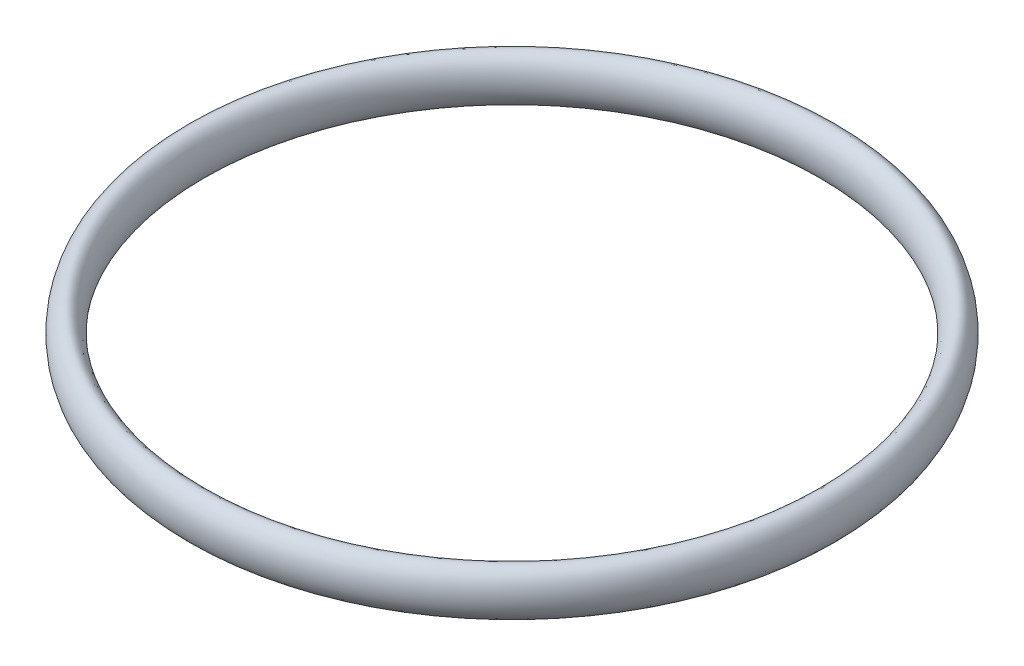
from build123d import *

# Parameters (mm, degrees)
ESQUISSE1_RX = 4.75
ESQUISSE1_RY = 2.92


with BuildPart() as part:
    # Esquisse1 → R_volution1 (revolve)
    with BuildSketch(Plane.XY):
        with Locations(Location((-64.58, -4.75), (0, 0, 90))):
            Ellipse(ESQUISSE1_RX, ESQUISSE1_RY)
    revolve(axis=Axis((0, 51.673755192, 0), (0, -1, 0)))


solid = part.part
